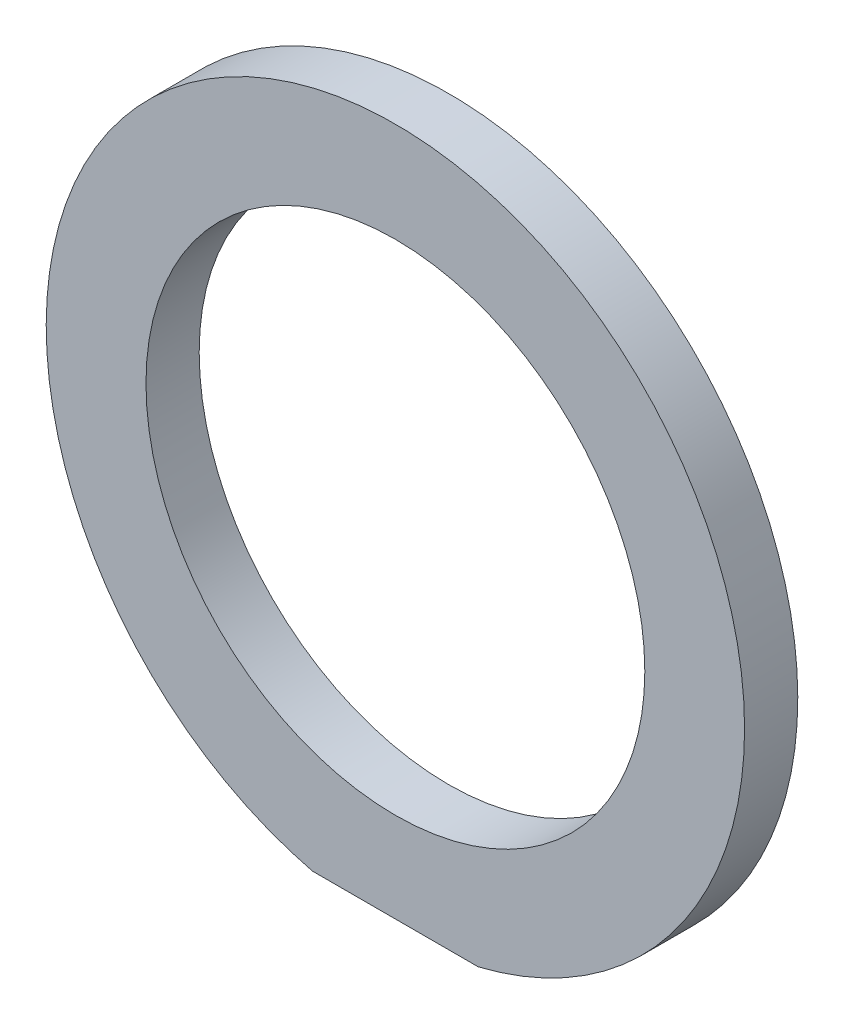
from build123d import *

# Parameters (mm, degrees)
SKETCH_1_R      = 37.5
EXTRUDE_1_DEPTH = 8


with BuildPart() as part:
    # Sketch 1 → Extrude 1 (new body)
    with BuildSketch(Plane.XY):
        with BuildLine():
            Line((-12.459935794, -51), (12.459935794, -51))
            ThreePointArc((12.459935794, -51), (0, 52.5), (-12.459935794, -51))
        make_face()
        Circle(SKETCH_1_R, mode=Mode.SUBTRACT)
    extrude(amount=EXTRUDE_1_DEPTH)


solid = part.part
